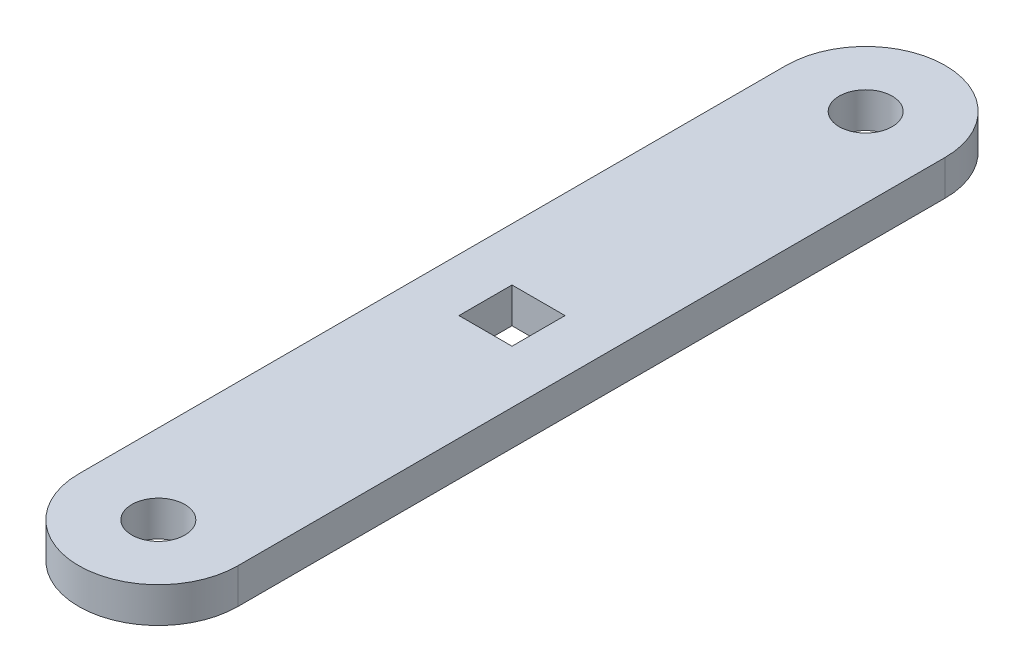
ISO-10303-21;
HEADER;
FILE_DESCRIPTION(('STEP AP214'),'2;1');
FILE_NAME('part.step','',(''),(''),'','','');
FILE_SCHEMA(('AUTOMOTIVE_DESIGN { 1 0 10303 214 1 1 1 1 }'));
ENDSEC;
DATA;
#1=APPLICATION_CONTEXT('core data for automotive mechanical design processes');
#2=APPLICATION_PROTOCOL_DEFINITION('international standard','automotive_design',2000,#1);
#3=PRODUCT_CONTEXT('',#1,'mechanical');
#4=PRODUCT('Part','Part','',(#3));
#5=PRODUCT_RELATED_PRODUCT_CATEGORY('part','',(#4));
#6=PRODUCT_DEFINITION_FORMATION('','',#4);
#7=PRODUCT_DEFINITION_CONTEXT('part definition',#1,'design');
#8=PRODUCT_DEFINITION('design','',#6,#7);
#9=PRODUCT_DEFINITION_SHAPE('','',#8);
#10=(LENGTH_UNIT() NAMED_UNIT(*) SI_UNIT(.MILLI.,.METRE.));
#11=(NAMED_UNIT(*) PLANE_ANGLE_UNIT() SI_UNIT($,.RADIAN.));
#12=(NAMED_UNIT(*) SI_UNIT($,.STERADIAN.) SOLID_ANGLE_UNIT());
#13=UNCERTAINTY_MEASURE_WITH_UNIT(LENGTH_MEASURE(1.E-05),#10,'distance_accuracy_value','');
#14=(GEOMETRIC_REPRESENTATION_CONTEXT(3) GLOBAL_UNCERTAINTY_ASSIGNED_CONTEXT((#13)) GLOBAL_UNIT_ASSIGNED_CONTEXT((#10,
#11,#12)) REPRESENTATION_CONTEXT('',''));
#15=CARTESIAN_POINT('',(0.,0.,0.));
#16=DIRECTION('',(0.,0.,1.));
#17=DIRECTION('',(1.,0.,0.));
#18=AXIS2_PLACEMENT_3D('',#15,#16,#17);
#19=CARTESIAN_POINT('',(-225.,100.,0.));
#20=DIRECTION('',(-1.,0.,0.));
#21=DIRECTION('',(0.,0.,1.));
#22=AXIS2_PLACEMENT_3D('',#19,#20,#21);
#23=PLANE('',#22);
#24=DIRECTION('',(0.,0.,-1.));
#25=VECTOR('',#24,1.);
#26=CARTESIAN_POINT('',(-225.,0.,0.));
#27=LINE('',#26,#25);
#28=CARTESIAN_POINT('',(-225.,0.,1000.));
#29=VERTEX_POINT('',#28);
#30=CARTESIAN_POINT('',(-225.,0.,-1000.));
#31=VERTEX_POINT('',#30);
#32=EDGE_CURVE('E181',#29,#31,#27,.T.);
#33=ORIENTED_EDGE('',*,*,#32,.F.);
#34=DIRECTION('',(0.,-1.,0.));
#35=VECTOR('',#34,1.);
#36=CARTESIAN_POINT('',(-225.,100.,1000.));
#37=LINE('',#36,#35);
#38=CARTESIAN_POINT('',(-225.,100.,1000.));
#39=VERTEX_POINT('',#38);
#40=EDGE_CURVE('E11',#39,#29,#37,.T.);
#41=ORIENTED_EDGE('',*,*,#40,.F.);
#42=DIRECTION('',(0.,0.,-1.));
#43=VECTOR('',#42,1.);
#44=CARTESIAN_POINT('',(-225.,100.,0.));
#45=LINE('',#44,#43);
#46=CARTESIAN_POINT('',(-225.,100.,-1000.));
#47=VERTEX_POINT('',#46);
#48=EDGE_CURVE('E165',#39,#47,#45,.T.);
#49=ORIENTED_EDGE('',*,*,#48,.T.);
#50=DIRECTION('',(0.,-1.,0.));
#51=VECTOR('',#50,1.);
#52=CARTESIAN_POINT('',(-225.,100.,-1000.));
#53=LINE('',#52,#51);
#54=EDGE_CURVE('E180',#47,#31,#53,.T.);
#55=ORIENTED_EDGE('',*,*,#54,.T.);
#56=EDGE_LOOP('',(#33,#41,#49,#55));
#57=FACE_BOUND('',#56,.T.);
#58=ADVANCED_FACE('F40',(#57),#23,.T.);
#59=CARTESIAN_POINT('',(0.,100.,1000.));
#60=DIRECTION('',(0.,-1.,0.));
#61=DIRECTION('',(0.,0.,-1.));
#62=AXIS2_PLACEMENT_3D('',#59,#60,#61);
#63=CYLINDRICAL_SURFACE('',#62,225.);
#64=CARTESIAN_POINT('',(0.,0.,1000.));
#65=DIRECTION('',(0.,1.,0.));
#66=DIRECTION('',(0.,0.,1.));
#67=AXIS2_PLACEMENT_3D('',#64,#65,#66);
#68=CIRCLE('',#67,225.);
#69=CARTESIAN_POINT('',(225.,0.,1000.));
#70=VERTEX_POINT('',#69);
#71=EDGE_CURVE('E185',#70,#29,#68,.F.);
#72=ORIENTED_EDGE('',*,*,#71,.F.);
#73=DIRECTION('',(0.,-1.,0.));
#74=VECTOR('',#73,1.);
#75=CARTESIAN_POINT('',(225.,100.,1000.));
#76=LINE('',#75,#74);
#77=CARTESIAN_POINT('',(225.,100.,1000.));
#78=VERTEX_POINT('',#77);
#79=EDGE_CURVE('E49',#78,#70,#76,.T.);
#80=ORIENTED_EDGE('',*,*,#79,.F.);
#81=CARTESIAN_POINT('',(0.,100.,1000.));
#82=DIRECTION('',(0.,1.,0.));
#83=DIRECTION('',(0.,0.,1.));
#84=AXIS2_PLACEMENT_3D('',#81,#82,#83);
#85=CIRCLE('',#84,225.);
#86=EDGE_CURVE('E169',#78,#39,#85,.F.);
#87=ORIENTED_EDGE('',*,*,#86,.T.);
#88=ORIENTED_EDGE('',*,*,#40,.T.);
#89=EDGE_LOOP('',(#72,#80,#87,#88));
#90=FACE_BOUND('',#89,.T.);
#91=ADVANCED_FACE('F212',(#90),#63,.T.);
#92=CARTESIAN_POINT('',(225.,100.,0.));
#93=DIRECTION('',(-1.,0.,0.));
#94=DIRECTION('',(0.,0.,1.));
#95=AXIS2_PLACEMENT_3D('',#92,#93,#94);
#96=PLANE('',#95);
#97=DIRECTION('',(0.,0.,-1.));
#98=VECTOR('',#97,1.);
#99=CARTESIAN_POINT('',(225.,0.,0.));
#100=LINE('',#99,#98);
#101=CARTESIAN_POINT('',(225.,0.,-1000.));
#102=VERTEX_POINT('',#101);
#103=EDGE_CURVE('E189',#70,#102,#100,.T.);
#104=ORIENTED_EDGE('',*,*,#103,.T.);
#105=DIRECTION('',(0.,-1.,0.));
#106=VECTOR('',#105,1.);
#107=CARTESIAN_POINT('',(225.,100.,-1000.));
#108=LINE('',#107,#106);
#109=CARTESIAN_POINT('',(225.,100.,-1000.));
#110=VERTEX_POINT('',#109);
#111=EDGE_CURVE('E197',#110,#102,#108,.T.);
#112=ORIENTED_EDGE('',*,*,#111,.F.);
#113=DIRECTION('',(0.,0.,-1.));
#114=VECTOR('',#113,1.);
#115=CARTESIAN_POINT('',(225.,100.,0.));
#116=LINE('',#115,#114);
#117=EDGE_CURVE('E174',#78,#110,#116,.T.);
#118=ORIENTED_EDGE('',*,*,#117,.F.);
#119=ORIENTED_EDGE('',*,*,#79,.T.);
#120=EDGE_LOOP('',(#104,#112,#118,#119));
#121=FACE_BOUND('',#120,.T.);
#122=ADVANCED_FACE('F205',(#121),#96,.F.);
#123=CARTESIAN_POINT('',(0.,100.,-1000.));
#124=DIRECTION('',(0.,-1.,0.));
#125=DIRECTION('',(0.,0.,-1.));
#126=AXIS2_PLACEMENT_3D('',#123,#124,#125);
#127=CYLINDRICAL_SURFACE('',#126,225.);
#128=CARTESIAN_POINT('',(0.,0.,-1000.));
#129=DIRECTION('',(0.,1.,0.));
#130=DIRECTION('',(0.,0.,1.));
#131=AXIS2_PLACEMENT_3D('',#128,#129,#130);
#132=CIRCLE('',#131,225.);
#133=EDGE_CURVE('E170',#102,#31,#132,.T.);
#134=ORIENTED_EDGE('',*,*,#133,.T.);
#135=ORIENTED_EDGE('',*,*,#54,.F.);
#136=CARTESIAN_POINT('',(0.,100.,-1000.));
#137=DIRECTION('',(0.,1.,0.));
#138=DIRECTION('',(0.,0.,1.));
#139=AXIS2_PLACEMENT_3D('',#136,#137,#138);
#140=CIRCLE('',#139,225.);
#141=EDGE_CURVE('E177',#110,#47,#140,.T.);
#142=ORIENTED_EDGE('',*,*,#141,.F.);
#143=ORIENTED_EDGE('',*,*,#111,.T.);
#144=EDGE_LOOP('',(#134,#135,#142,#143));
#145=FACE_BOUND('',#144,.T.);
#146=ADVANCED_FACE('F219',(#145),#127,.T.);
#147=CARTESIAN_POINT('',(0.,100.,0.));
#148=DIRECTION('',(0.,1.,0.));
#149=DIRECTION('',(0.,0.,1.));
#150=AXIS2_PLACEMENT_3D('',#147,#148,#149);
#151=PLANE('',#150);
#152=DIRECTION('',(0.,0.,-1.));
#153=VECTOR('',#152,1.);
#154=CARTESIAN_POINT('',(75.,100.,75.));
#155=LINE('',#154,#153);
#156=CARTESIAN_POINT('',(75.,100.,75.));
#157=VERTEX_POINT('',#156);
#158=CARTESIAN_POINT('',(75.,100.,-75.));
#159=VERTEX_POINT('',#158);
#160=EDGE_CURVE('E56',#157,#159,#155,.T.);
#161=ORIENTED_EDGE('',*,*,#160,.F.);
#162=DIRECTION('',(1.,0.,0.));
#163=VECTOR('',#162,1.);
#164=CARTESIAN_POINT('',(-75.,100.,75.));
#165=LINE('',#164,#163);
#166=CARTESIAN_POINT('',(-75.,100.,75.));
#167=VERTEX_POINT('',#166);
#168=EDGE_CURVE('E126',#167,#157,#165,.T.);
#169=ORIENTED_EDGE('',*,*,#168,.F.);
#170=DIRECTION('',(0.,0.,1.));
#171=VECTOR('',#170,1.);
#172=CARTESIAN_POINT('',(-75.,100.,75.));
#173=LINE('',#172,#171);
#174=CARTESIAN_POINT('',(-75.,100.,-75.));
#175=VERTEX_POINT('',#174);
#176=EDGE_CURVE('E130',#175,#167,#173,.T.);
#177=ORIENTED_EDGE('',*,*,#176,.F.);
#178=DIRECTION('',(-1.,0.,0.));
#179=VECTOR('',#178,1.);
#180=CARTESIAN_POINT('',(-75.,100.,-75.));
#181=LINE('',#180,#179);
#182=EDGE_CURVE('E139',#159,#175,#181,.T.);
#183=ORIENTED_EDGE('',*,*,#182,.F.);
#184=EDGE_LOOP('',(#161,#169,#177,#183));
#185=FACE_BOUND('',#184,.T.);
#186=CARTESIAN_POINT('',(0.,100.,1000.));
#187=DIRECTION('',(0.,1.,0.));
#188=DIRECTION('',(0.,0.,1.));
#189=AXIS2_PLACEMENT_3D('',#186,#187,#188);
#190=CIRCLE('',#189,75.);
#191=CARTESIAN_POINT('',(0.,100.,1075.));
#192=VERTEX_POINT('',#191);
#193=EDGE_CURVE('E148',#192,#192,#190,.T.);
#194=ORIENTED_EDGE('',*,*,#193,.F.);
#195=EDGE_LOOP('',(#194));
#196=FACE_BOUND('',#195,.T.);
#197=CARTESIAN_POINT('',(0.,100.,-1000.));
#198=DIRECTION('',(0.,1.,0.));
#199=DIRECTION('',(0.,0.,1.));
#200=AXIS2_PLACEMENT_3D('',#197,#198,#199);
#201=CIRCLE('',#200,75.);
#202=CARTESIAN_POINT('',(0.,100.,-925.));
#203=VERTEX_POINT('',#202);
#204=EDGE_CURVE('E158',#203,#203,#201,.T.);
#205=ORIENTED_EDGE('',*,*,#204,.F.);
#206=EDGE_LOOP('',(#205));
#207=FACE_BOUND('',#206,.T.);
#208=ORIENTED_EDGE('',*,*,#48,.F.);
#209=ORIENTED_EDGE('',*,*,#86,.F.);
#210=ORIENTED_EDGE('',*,*,#117,.T.);
#211=ORIENTED_EDGE('',*,*,#141,.T.);
#212=EDGE_LOOP('',(#208,#209,#210,#211));
#213=FACE_BOUND('',#212,.T.);
#214=ADVANCED_FACE('F221',(#185,#196,#207,#213),#151,.T.);
#215=CARTESIAN_POINT('',(0.,0.,0.));
#216=DIRECTION('',(0.,1.,0.));
#217=DIRECTION('',(0.,0.,1.));
#218=AXIS2_PLACEMENT_3D('',#215,#216,#217);
#219=PLANE('',#218);
#220=DIRECTION('',(1.,0.,0.));
#221=VECTOR('',#220,1.);
#222=CARTESIAN_POINT('',(-75.,0.,75.));
#223=LINE('',#222,#221);
#224=CARTESIAN_POINT('',(-75.,0.,75.));
#225=VERTEX_POINT('',#224);
#226=CARTESIAN_POINT('',(75.,0.,75.));
#227=VERTEX_POINT('',#226);
#228=EDGE_CURVE('E114',#225,#227,#223,.T.);
#229=ORIENTED_EDGE('',*,*,#228,.T.);
#230=DIRECTION('',(0.,0.,-1.));
#231=VECTOR('',#230,1.);
#232=CARTESIAN_POINT('',(75.,0.,75.));
#233=LINE('',#232,#231);
#234=CARTESIAN_POINT('',(75.,0.,-75.));
#235=VERTEX_POINT('',#234);
#236=EDGE_CURVE('E107',#227,#235,#233,.T.);
#237=ORIENTED_EDGE('',*,*,#236,.T.);
#238=DIRECTION('',(-1.,0.,0.));
#239=VECTOR('',#238,1.);
#240=CARTESIAN_POINT('',(-75.,0.,-75.));
#241=LINE('',#240,#239);
#242=CARTESIAN_POINT('',(-75.,0.,-75.));
#243=VERTEX_POINT('',#242);
#244=EDGE_CURVE('E117',#235,#243,#241,.T.);
#245=ORIENTED_EDGE('',*,*,#244,.T.);
#246=DIRECTION('',(0.,0.,1.));
#247=VECTOR('',#246,1.);
#248=CARTESIAN_POINT('',(-75.,0.,75.));
#249=LINE('',#248,#247);
#250=EDGE_CURVE('E64',#243,#225,#249,.T.);
#251=ORIENTED_EDGE('',*,*,#250,.T.);
#252=EDGE_LOOP('',(#229,#237,#245,#251));
#253=FACE_BOUND('',#252,.T.);
#254=CARTESIAN_POINT('',(0.,0.,1000.));
#255=DIRECTION('',(0.,1.,0.));
#256=DIRECTION('',(0.,0.,1.));
#257=AXIS2_PLACEMENT_3D('',#254,#255,#256);
#258=CIRCLE('',#257,75.);
#259=CARTESIAN_POINT('',(0.,0.,1075.));
#260=VERTEX_POINT('',#259);
#261=EDGE_CURVE('E154',#260,#260,#258,.T.);
#262=ORIENTED_EDGE('',*,*,#261,.T.);
#263=EDGE_LOOP('',(#262));
#264=FACE_BOUND('',#263,.T.);
#265=CARTESIAN_POINT('',(0.,0.,-1000.));
#266=DIRECTION('',(0.,1.,0.));
#267=DIRECTION('',(0.,0.,1.));
#268=AXIS2_PLACEMENT_3D('',#265,#266,#267);
#269=CIRCLE('',#268,75.);
#270=CARTESIAN_POINT('',(0.,0.,-925.));
#271=VERTEX_POINT('',#270);
#272=EDGE_CURVE('E43',#271,#271,#269,.T.);
#273=ORIENTED_EDGE('',*,*,#272,.T.);
#274=EDGE_LOOP('',(#273));
#275=FACE_BOUND('',#274,.T.);
#276=ORIENTED_EDGE('',*,*,#32,.T.);
#277=ORIENTED_EDGE('',*,*,#133,.F.);
#278=ORIENTED_EDGE('',*,*,#103,.F.);
#279=ORIENTED_EDGE('',*,*,#71,.T.);
#280=EDGE_LOOP('',(#276,#277,#278,#279));
#281=FACE_BOUND('',#280,.T.);
#282=ADVANCED_FACE('F122',(#253,#264,#275,#281),#219,.F.);
#283=CARTESIAN_POINT('',(0.,-150.,-1000.));
#284=DIRECTION('',(0.,1.,0.));
#285=DIRECTION('',(0.,0.,1.));
#286=AXIS2_PLACEMENT_3D('',#283,#284,#285);
#287=CYLINDRICAL_SURFACE('',#286,75.);
#288=ORIENTED_EDGE('',*,*,#204,.T.);
#289=EDGE_LOOP('',(#288));
#290=FACE_BOUND('',#289,.T.);
#291=ORIENTED_EDGE('',*,*,#272,.F.);
#292=EDGE_LOOP('',(#291));
#293=FACE_BOUND('',#292,.T.);
#294=ADVANCED_FACE('F229',(#290,#293),#287,.F.);
#295=CARTESIAN_POINT('',(0.,0.,1000.));
#296=DIRECTION('',(0.,1.,0.));
#297=DIRECTION('',(0.,0.,1.));
#298=AXIS2_PLACEMENT_3D('',#295,#296,#297);
#299=CYLINDRICAL_SURFACE('',#298,75.);
#300=ORIENTED_EDGE('',*,*,#261,.F.);
#301=EDGE_LOOP('',(#300));
#302=FACE_BOUND('',#301,.T.);
#303=ORIENTED_EDGE('',*,*,#193,.T.);
#304=EDGE_LOOP('',(#303));
#305=FACE_BOUND('',#304,.T.);
#306=ADVANCED_FACE('F270',(#302,#305),#299,.F.);
#307=CARTESIAN_POINT('',(75.,0.,75.));
#308=DIRECTION('',(1.,0.,0.));
#309=DIRECTION('',(0.,0.,-1.));
#310=AXIS2_PLACEMENT_3D('',#307,#308,#309);
#311=PLANE('',#310);
#312=ORIENTED_EDGE('',*,*,#160,.T.);
#313=DIRECTION('',(0.,1.,0.));
#314=VECTOR('',#313,1.);
#315=CARTESIAN_POINT('',(75.,0.,-75.));
#316=LINE('',#315,#314);
#317=EDGE_CURVE('E103',#235,#159,#316,.T.);
#318=ORIENTED_EDGE('',*,*,#317,.F.);
#319=ORIENTED_EDGE('',*,*,#236,.F.);
#320=DIRECTION('',(0.,1.,0.));
#321=VECTOR('',#320,1.);
#322=CARTESIAN_POINT('',(75.,0.,75.));
#323=LINE('',#322,#321);
#324=EDGE_CURVE('E145',#227,#157,#323,.T.);
#325=ORIENTED_EDGE('',*,*,#324,.T.);
#326=EDGE_LOOP('',(#312,#318,#319,#325));
#327=FACE_BOUND('',#326,.T.);
#328=ADVANCED_FACE('F105',(#327),#311,.F.);
#329=CARTESIAN_POINT('',(-75.,0.,75.));
#330=DIRECTION('',(0.,0.,1.));
#331=DIRECTION('',(1.,0.,0.));
#332=AXIS2_PLACEMENT_3D('',#329,#330,#331);
#333=PLANE('',#332);
#334=ORIENTED_EDGE('',*,*,#168,.T.);
#335=ORIENTED_EDGE('',*,*,#324,.F.);
#336=ORIENTED_EDGE('',*,*,#228,.F.);
#337=DIRECTION('',(0.,1.,0.));
#338=VECTOR('',#337,1.);
#339=CARTESIAN_POINT('',(-75.,0.,75.));
#340=LINE('',#339,#338);
#341=EDGE_CURVE('E149',#225,#167,#340,.T.);
#342=ORIENTED_EDGE('',*,*,#341,.T.);
#343=EDGE_LOOP('',(#334,#335,#336,#342));
#344=FACE_BOUND('',#343,.T.);
#345=ADVANCED_FACE('F281',(#344),#333,.F.);
#346=CARTESIAN_POINT('',(-75.,0.,75.));
#347=DIRECTION('',(-1.,0.,0.));
#348=DIRECTION('',(0.,0.,1.));
#349=AXIS2_PLACEMENT_3D('',#346,#347,#348);
#350=PLANE('',#349);
#351=ORIENTED_EDGE('',*,*,#176,.T.);
#352=ORIENTED_EDGE('',*,*,#341,.F.);
#353=ORIENTED_EDGE('',*,*,#250,.F.);
#354=DIRECTION('',(0.,1.,0.));
#355=VECTOR('',#354,1.);
#356=CARTESIAN_POINT('',(-75.,0.,-75.));
#357=LINE('',#356,#355);
#358=EDGE_CURVE('E113',#243,#175,#357,.T.);
#359=ORIENTED_EDGE('',*,*,#358,.T.);
#360=EDGE_LOOP('',(#351,#352,#353,#359));
#361=FACE_BOUND('',#360,.T.);
#362=ADVANCED_FACE('F288',(#361),#350,.F.);
#363=CARTESIAN_POINT('',(-75.,0.,-75.));
#364=DIRECTION('',(0.,0.,-1.));
#365=DIRECTION('',(-1.,0.,0.));
#366=AXIS2_PLACEMENT_3D('',#363,#364,#365);
#367=PLANE('',#366);
#368=ORIENTED_EDGE('',*,*,#182,.T.);
#369=ORIENTED_EDGE('',*,*,#358,.F.);
#370=ORIENTED_EDGE('',*,*,#244,.F.);
#371=ORIENTED_EDGE('',*,*,#317,.T.);
#372=EDGE_LOOP('',(#368,#369,#370,#371));
#373=FACE_BOUND('',#372,.T.);
#374=ADVANCED_FACE('F118',(#373),#367,.F.);
#375=CLOSED_SHELL('',(#58,#91,#122,#146,#214,#282,#294,#306,#328,#345,#362,#374));
#376=MANIFOLD_SOLID_BREP('B2',#375);
#377=ADVANCED_BREP_SHAPE_REPRESENTATION('',(#18,#376),#14);
#378=SHAPE_DEFINITION_REPRESENTATION(#9,#377);
ENDSEC;
END-ISO-10303-21;
